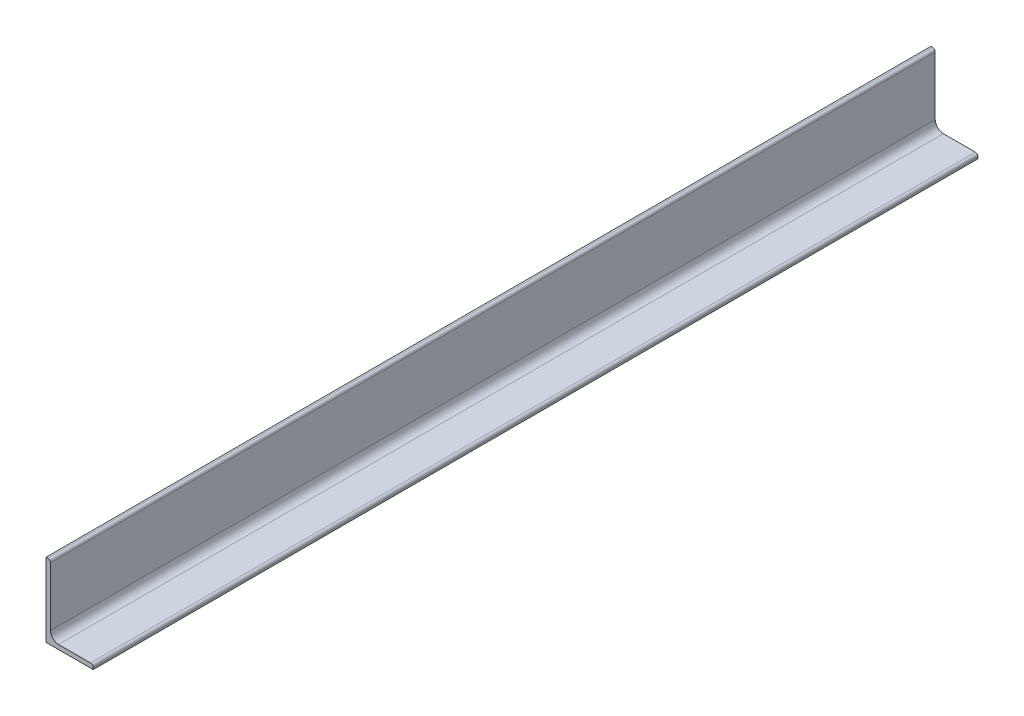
ISO-10303-21;
HEADER;
FILE_DESCRIPTION(('STEP AP214'),'2;1');
FILE_NAME('part.step','',(''),(''),'','','');
FILE_SCHEMA(('AUTOMOTIVE_DESIGN { 1 0 10303 214 1 1 1 1 }'));
ENDSEC;
DATA;
#1=APPLICATION_CONTEXT('core data for automotive mechanical design processes');
#2=APPLICATION_PROTOCOL_DEFINITION('international standard','automotive_design',2000,#1);
#3=PRODUCT_CONTEXT('',#1,'mechanical');
#4=PRODUCT('Part','Part','',(#3));
#5=PRODUCT_RELATED_PRODUCT_CATEGORY('part','',(#4));
#6=PRODUCT_DEFINITION_FORMATION('','',#4);
#7=PRODUCT_DEFINITION_CONTEXT('part definition',#1,'design');
#8=PRODUCT_DEFINITION('design','',#6,#7);
#9=PRODUCT_DEFINITION_SHAPE('','',#8);
#10=(LENGTH_UNIT() NAMED_UNIT(*) SI_UNIT(.MILLI.,.METRE.));
#11=(NAMED_UNIT(*) PLANE_ANGLE_UNIT() SI_UNIT($,.RADIAN.));
#12=(NAMED_UNIT(*) SI_UNIT($,.STERADIAN.) SOLID_ANGLE_UNIT());
#13=UNCERTAINTY_MEASURE_WITH_UNIT(LENGTH_MEASURE(1.E-05),#10,'distance_accuracy_value','');
#14=(GEOMETRIC_REPRESENTATION_CONTEXT(3) GLOBAL_UNCERTAINTY_ASSIGNED_CONTEXT((#13)) GLOBAL_UNIT_ASSIGNED_CONTEXT((#10,
#11,#12)) REPRESENTATION_CONTEXT('',''));
#15=CARTESIAN_POINT('',(0.,0.,0.));
#16=DIRECTION('',(0.,0.,1.));
#17=DIRECTION('',(1.,0.,0.));
#18=AXIS2_PLACEMENT_3D('',#15,#16,#17);
#19=CARTESIAN_POINT('',(32.,0.,600.));
#20=DIRECTION('',(0.,1.,0.));
#21=DIRECTION('',(-1.,0.,0.));
#22=AXIS2_PLACEMENT_3D('',#19,#20,#21);
#23=PLANE('',#22);
#24=DIRECTION('',(1.,0.,0.));
#25=VECTOR('',#24,1.);
#26=CARTESIAN_POINT('',(32.,0.,0.));
#27=LINE('',#26,#25);
#28=CARTESIAN_POINT('',(0.,0.,0.));
#29=VERTEX_POINT('',#28);
#30=CARTESIAN_POINT('',(32.,0.,0.));
#31=VERTEX_POINT('',#30);
#32=EDGE_CURVE('E134',#29,#31,#27,.T.);
#33=ORIENTED_EDGE('',*,*,#32,.T.);
#34=DIRECTION('',(0.,0.,-1.));
#35=VECTOR('',#34,1.);
#36=CARTESIAN_POINT('',(32.,0.,600.));
#37=LINE('',#36,#35);
#38=CARTESIAN_POINT('',(32.,0.,600.));
#39=VERTEX_POINT('',#38);
#40=EDGE_CURVE('E11',#39,#31,#37,.T.);
#41=ORIENTED_EDGE('',*,*,#40,.F.);
#42=DIRECTION('',(1.,0.,0.));
#43=VECTOR('',#42,1.);
#44=CARTESIAN_POINT('',(32.,0.,600.));
#45=LINE('',#44,#43);
#46=CARTESIAN_POINT('',(0.,0.,600.));
#47=VERTEX_POINT('',#46);
#48=EDGE_CURVE('E150',#47,#39,#45,.T.);
#49=ORIENTED_EDGE('',*,*,#48,.F.);
#50=DIRECTION('',(0.,0.,-1.));
#51=VECTOR('',#50,1.);
#52=CARTESIAN_POINT('',(0.,0.,600.));
#53=LINE('',#52,#51);
#54=EDGE_CURVE('E130',#47,#29,#53,.T.);
#55=ORIENTED_EDGE('',*,*,#54,.T.);
#56=EDGE_LOOP('',(#33,#41,#49,#55));
#57=FACE_BOUND('',#56,.T.);
#58=ADVANCED_FACE('F32',(#57),#23,.F.);
#59=CARTESIAN_POINT('',(32.,1.2,600.));
#60=DIRECTION('',(-1.,0.,0.));
#61=DIRECTION('',(0.,0.,1.));
#62=AXIS2_PLACEMENT_3D('',#59,#60,#61);
#63=PLANE('',#62);
#64=DIRECTION('',(0.,1.,0.));
#65=VECTOR('',#64,1.);
#66=CARTESIAN_POINT('',(32.,1.2,0.));
#67=LINE('',#66,#65);
#68=CARTESIAN_POINT('',(32.,1.2,0.));
#69=VERTEX_POINT('',#68);
#70=EDGE_CURVE('E137',#31,#69,#67,.T.);
#71=ORIENTED_EDGE('',*,*,#70,.T.);
#72=DIRECTION('',(0.,0.,-1.));
#73=VECTOR('',#72,1.);
#74=CARTESIAN_POINT('',(32.,1.2,600.));
#75=LINE('',#74,#73);
#76=CARTESIAN_POINT('',(32.,1.2,600.));
#77=VERTEX_POINT('',#76);
#78=EDGE_CURVE('E40',#77,#69,#75,.T.);
#79=ORIENTED_EDGE('',*,*,#78,.F.);
#80=DIRECTION('',(0.,1.,0.));
#81=VECTOR('',#80,1.);
#82=CARTESIAN_POINT('',(32.,1.2,600.));
#83=LINE('',#82,#81);
#84=EDGE_CURVE('E94',#39,#77,#83,.T.);
#85=ORIENTED_EDGE('',*,*,#84,.F.);
#86=ORIENTED_EDGE('',*,*,#40,.T.);
#87=EDGE_LOOP('',(#71,#79,#85,#86));
#88=FACE_BOUND('',#87,.T.);
#89=ADVANCED_FACE('F193',(#88),#63,.F.);
#90=CARTESIAN_POINT('',(30.2,1.2,600.));
#91=DIRECTION('',(0.,0.,-1.));
#92=DIRECTION('',(-1.,0.,0.));
#93=AXIS2_PLACEMENT_3D('',#90,#91,#92);
#94=CYLINDRICAL_SURFACE('',#93,1.8);
#95=CARTESIAN_POINT('',(30.2,1.2,0.));
#96=DIRECTION('',(0.,0.,1.));
#97=DIRECTION('',(1.,0.,0.));
#98=AXIS2_PLACEMENT_3D('',#95,#96,#97);
#99=CIRCLE('',#98,1.8);
#100=CARTESIAN_POINT('',(30.2,3.,0.));
#101=VERTEX_POINT('',#100);
#102=EDGE_CURVE('E139',#69,#101,#99,.T.);
#103=ORIENTED_EDGE('',*,*,#102,.T.);
#104=DIRECTION('',(0.,0.,-1.));
#105=VECTOR('',#104,1.);
#106=CARTESIAN_POINT('',(30.2,3.,600.));
#107=LINE('',#106,#105);
#108=CARTESIAN_POINT('',(30.2,3.,600.));
#109=VERTEX_POINT('',#108);
#110=EDGE_CURVE('E160',#109,#101,#107,.T.);
#111=ORIENTED_EDGE('',*,*,#110,.F.);
#112=CARTESIAN_POINT('',(30.2,1.2,600.));
#113=DIRECTION('',(0.,0.,1.));
#114=DIRECTION('',(1.,0.,0.));
#115=AXIS2_PLACEMENT_3D('',#112,#113,#114);
#116=CIRCLE('',#115,1.8);
#117=EDGE_CURVE('E168',#77,#109,#116,.T.);
#118=ORIENTED_EDGE('',*,*,#117,.F.);
#119=ORIENTED_EDGE('',*,*,#78,.T.);
#120=EDGE_LOOP('',(#103,#111,#118,#119));
#121=FACE_BOUND('',#120,.T.);
#122=ADVANCED_FACE('F166',(#121),#94,.T.);
#123=CARTESIAN_POINT('',(8.50000000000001,3.,600.));
#124=DIRECTION('',(0.,-1.,0.));
#125=DIRECTION('',(0.,0.,-1.));
#126=AXIS2_PLACEMENT_3D('',#123,#124,#125);
#127=PLANE('',#126);
#128=DIRECTION('',(-1.,0.,0.));
#129=VECTOR('',#128,1.);
#130=CARTESIAN_POINT('',(8.50000000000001,3.,0.));
#131=LINE('',#130,#129);
#132=CARTESIAN_POINT('',(8.50000000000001,3.,0.));
#133=VERTEX_POINT('',#132);
#134=EDGE_CURVE('E141',#101,#133,#131,.T.);
#135=ORIENTED_EDGE('',*,*,#134,.T.);
#136=DIRECTION('',(0.,0.,-1.));
#137=VECTOR('',#136,1.);
#138=CARTESIAN_POINT('',(8.50000000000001,3.,600.));
#139=LINE('',#138,#137);
#140=CARTESIAN_POINT('',(8.50000000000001,3.,600.));
#141=VERTEX_POINT('',#140);
#142=EDGE_CURVE('E157',#141,#133,#139,.T.);
#143=ORIENTED_EDGE('',*,*,#142,.F.);
#144=DIRECTION('',(-1.,0.,0.));
#145=VECTOR('',#144,1.);
#146=CARTESIAN_POINT('',(8.50000000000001,3.,600.));
#147=LINE('',#146,#145);
#148=EDGE_CURVE('E184',#109,#141,#147,.T.);
#149=ORIENTED_EDGE('',*,*,#148,.F.);
#150=ORIENTED_EDGE('',*,*,#110,.T.);
#151=EDGE_LOOP('',(#135,#143,#149,#150));
#152=FACE_BOUND('',#151,.T.);
#153=ADVANCED_FACE('F177',(#152),#127,.F.);
#154=CARTESIAN_POINT('',(8.50000000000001,8.5,600.));
#155=DIRECTION('',(0.,0.,-1.));
#156=DIRECTION('',(-1.,0.,0.));
#157=AXIS2_PLACEMENT_3D('',#154,#155,#156);
#158=CYLINDRICAL_SURFACE('',#157,5.5);
#159=CARTESIAN_POINT('',(8.50000000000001,8.5,0.));
#160=DIRECTION('',(0.,0.,-1.));
#161=DIRECTION('',(-1.,0.,0.));
#162=AXIS2_PLACEMENT_3D('',#159,#160,#161);
#163=CIRCLE('',#162,5.5);
#164=CARTESIAN_POINT('',(3.00000000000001,8.5,0.));
#165=VERTEX_POINT('',#164);
#166=EDGE_CURVE('E143',#133,#165,#163,.T.);
#167=ORIENTED_EDGE('',*,*,#166,.T.);
#168=DIRECTION('',(0.,0.,-1.));
#169=VECTOR('',#168,1.);
#170=CARTESIAN_POINT('',(3.00000000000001,8.5,600.));
#171=LINE('',#170,#169);
#172=CARTESIAN_POINT('',(3.00000000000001,8.5,600.));
#173=VERTEX_POINT('',#172);
#174=EDGE_CURVE('E154',#173,#165,#171,.T.);
#175=ORIENTED_EDGE('',*,*,#174,.F.);
#176=CARTESIAN_POINT('',(8.50000000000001,8.5,600.));
#177=DIRECTION('',(0.,0.,-1.));
#178=DIRECTION('',(-1.,0.,0.));
#179=AXIS2_PLACEMENT_3D('',#176,#177,#178);
#180=CIRCLE('',#179,5.5);
#181=EDGE_CURVE('E183',#141,#173,#180,.T.);
#182=ORIENTED_EDGE('',*,*,#181,.F.);
#183=ORIENTED_EDGE('',*,*,#142,.T.);
#184=EDGE_LOOP('',(#167,#175,#182,#183));
#185=FACE_BOUND('',#184,.T.);
#186=ADVANCED_FACE('F181',(#185),#158,.F.);
#187=CARTESIAN_POINT('',(3.,48.2,600.));
#188=DIRECTION('',(-1.,0.,0.));
#189=DIRECTION('',(0.,-1.,0.));
#190=AXIS2_PLACEMENT_3D('',#187,#188,#189);
#191=PLANE('',#190);
#192=DIRECTION('',(0.,1.,0.));
#193=VECTOR('',#192,1.);
#194=CARTESIAN_POINT('',(3.,48.2,0.));
#195=LINE('',#194,#193);
#196=CARTESIAN_POINT('',(3.00000000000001,48.2,0.));
#197=VERTEX_POINT('',#196);
#198=EDGE_CURVE('E145',#165,#197,#195,.T.);
#199=ORIENTED_EDGE('',*,*,#198,.T.);
#200=DIRECTION('',(0.,0.,-1.));
#201=VECTOR('',#200,1.);
#202=CARTESIAN_POINT('',(3.00000000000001,48.2,600.));
#203=LINE('',#202,#201);
#204=CARTESIAN_POINT('',(3.00000000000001,48.2,600.));
#205=VERTEX_POINT('',#204);
#206=EDGE_CURVE('E125',#205,#197,#203,.T.);
#207=ORIENTED_EDGE('',*,*,#206,.F.);
#208=DIRECTION('',(0.,1.,0.));
#209=VECTOR('',#208,1.);
#210=CARTESIAN_POINT('',(3.,48.2,600.));
#211=LINE('',#210,#209);
#212=EDGE_CURVE('E116',#173,#205,#211,.T.);
#213=ORIENTED_EDGE('',*,*,#212,.F.);
#214=ORIENTED_EDGE('',*,*,#174,.T.);
#215=EDGE_LOOP('',(#199,#207,#213,#214));
#216=FACE_BOUND('',#215,.T.);
#217=ADVANCED_FACE('F205',(#216),#191,.F.);
#218=CARTESIAN_POINT('',(1.2,48.2,600.));
#219=DIRECTION('',(0.,0.,-1.));
#220=DIRECTION('',(-1.,0.,0.));
#221=AXIS2_PLACEMENT_3D('',#218,#219,#220);
#222=CYLINDRICAL_SURFACE('',#221,1.8);
#223=CARTESIAN_POINT('',(1.2,48.2,0.));
#224=DIRECTION('',(0.,0.,1.));
#225=DIRECTION('',(1.,0.,0.));
#226=AXIS2_PLACEMENT_3D('',#223,#224,#225);
#227=CIRCLE('',#226,1.8);
#228=CARTESIAN_POINT('',(1.2,50.,0.));
#229=VERTEX_POINT('',#228);
#230=EDGE_CURVE('E124',#197,#229,#227,.T.);
#231=ORIENTED_EDGE('',*,*,#230,.T.);
#232=DIRECTION('',(0.,0.,-1.));
#233=VECTOR('',#232,1.);
#234=CARTESIAN_POINT('',(1.2,50.,600.));
#235=LINE('',#234,#233);
#236=CARTESIAN_POINT('',(1.2,50.,600.));
#237=VERTEX_POINT('',#236);
#238=EDGE_CURVE('E121',#237,#229,#235,.T.);
#239=ORIENTED_EDGE('',*,*,#238,.F.);
#240=CARTESIAN_POINT('',(1.2,48.2,600.));
#241=DIRECTION('',(0.,0.,1.));
#242=DIRECTION('',(1.,0.,0.));
#243=AXIS2_PLACEMENT_3D('',#240,#241,#242);
#244=CIRCLE('',#243,1.8);
#245=EDGE_CURVE('E110',#205,#237,#244,.T.);
#246=ORIENTED_EDGE('',*,*,#245,.F.);
#247=ORIENTED_EDGE('',*,*,#206,.T.);
#248=EDGE_LOOP('',(#231,#239,#246,#247));
#249=FACE_BOUND('',#248,.T.);
#250=ADVANCED_FACE('F122',(#249),#222,.T.);
#251=CARTESIAN_POINT('',(0.,50.,600.));
#252=DIRECTION('',(0.,-1.,0.));
#253=DIRECTION('',(1.,0.,0.));
#254=AXIS2_PLACEMENT_3D('',#251,#252,#253);
#255=PLANE('',#254);
#256=DIRECTION('',(-1.,0.,0.));
#257=VECTOR('',#256,1.);
#258=CARTESIAN_POINT('',(0.,50.,0.));
#259=LINE('',#258,#257);
#260=CARTESIAN_POINT('',(0.,50.,0.));
#261=VERTEX_POINT('',#260);
#262=EDGE_CURVE('E80',#229,#261,#259,.T.);
#263=ORIENTED_EDGE('',*,*,#262,.T.);
#264=DIRECTION('',(0.,0.,-1.));
#265=VECTOR('',#264,1.);
#266=CARTESIAN_POINT('',(0.,50.,600.));
#267=LINE('',#266,#265);
#268=CARTESIAN_POINT('',(0.,50.,600.));
#269=VERTEX_POINT('',#268);
#270=EDGE_CURVE('E126',#269,#261,#267,.T.);
#271=ORIENTED_EDGE('',*,*,#270,.F.);
#272=DIRECTION('',(-1.,0.,0.));
#273=VECTOR('',#272,1.);
#274=CARTESIAN_POINT('',(0.,50.,600.));
#275=LINE('',#274,#273);
#276=EDGE_CURVE('E114',#237,#269,#275,.T.);
#277=ORIENTED_EDGE('',*,*,#276,.F.);
#278=ORIENTED_EDGE('',*,*,#238,.T.);
#279=EDGE_LOOP('',(#263,#271,#277,#278));
#280=FACE_BOUND('',#279,.T.);
#281=ADVANCED_FACE('F128',(#280),#255,.F.);
#282=CARTESIAN_POINT('',(0.,0.,600.));
#283=DIRECTION('',(1.,0.,0.));
#284=DIRECTION('',(0.,0.,-1.));
#285=AXIS2_PLACEMENT_3D('',#282,#283,#284);
#286=PLANE('',#285);
#287=DIRECTION('',(0.,-1.,0.));
#288=VECTOR('',#287,1.);
#289=CARTESIAN_POINT('',(0.,0.,0.));
#290=LINE('',#289,#288);
#291=EDGE_CURVE('E86',#261,#29,#290,.T.);
#292=ORIENTED_EDGE('',*,*,#291,.T.);
#293=ORIENTED_EDGE('',*,*,#54,.F.);
#294=DIRECTION('',(0.,-1.,0.));
#295=VECTOR('',#294,1.);
#296=CARTESIAN_POINT('',(0.,0.,600.));
#297=LINE('',#296,#295);
#298=EDGE_CURVE('E48',#269,#47,#297,.T.);
#299=ORIENTED_EDGE('',*,*,#298,.F.);
#300=ORIENTED_EDGE('',*,*,#270,.T.);
#301=EDGE_LOOP('',(#292,#293,#299,#300));
#302=FACE_BOUND('',#301,.T.);
#303=ADVANCED_FACE('F213',(#302),#286,.F.);
#304=CARTESIAN_POINT('',(1.2,48.2,600.));
#305=DIRECTION('',(0.,0.,1.));
#306=DIRECTION('',(1.,0.,0.));
#307=AXIS2_PLACEMENT_3D('',#304,#305,#306);
#308=PLANE('',#307);
#309=ORIENTED_EDGE('',*,*,#48,.T.);
#310=ORIENTED_EDGE('',*,*,#84,.T.);
#311=ORIENTED_EDGE('',*,*,#117,.T.);
#312=ORIENTED_EDGE('',*,*,#148,.T.);
#313=ORIENTED_EDGE('',*,*,#181,.T.);
#314=ORIENTED_EDGE('',*,*,#212,.T.);
#315=ORIENTED_EDGE('',*,*,#245,.T.);
#316=ORIENTED_EDGE('',*,*,#276,.T.);
#317=ORIENTED_EDGE('',*,*,#298,.T.);
#318=EDGE_LOOP('',(#309,#310,#311,#312,#313,#314,#315,#316,#317));
#319=FACE_BOUND('',#318,.T.);
#320=ADVANCED_FACE('F112',(#319),#308,.T.);
#321=CARTESIAN_POINT('',(1.2,48.2,0.));
#322=DIRECTION('',(0.,0.,1.));
#323=DIRECTION('',(1.,0.,0.));
#324=AXIS2_PLACEMENT_3D('',#321,#322,#323);
#325=PLANE('',#324);
#326=ORIENTED_EDGE('',*,*,#32,.F.);
#327=ORIENTED_EDGE('',*,*,#291,.F.);
#328=ORIENTED_EDGE('',*,*,#262,.F.);
#329=ORIENTED_EDGE('',*,*,#230,.F.);
#330=ORIENTED_EDGE('',*,*,#198,.F.);
#331=ORIENTED_EDGE('',*,*,#166,.F.);
#332=ORIENTED_EDGE('',*,*,#134,.F.);
#333=ORIENTED_EDGE('',*,*,#102,.F.);
#334=ORIENTED_EDGE('',*,*,#70,.F.);
#335=EDGE_LOOP('',(#326,#327,#328,#329,#330,#331,#332,#333,#334));
#336=FACE_BOUND('',#335,.T.);
#337=ADVANCED_FACE('F172',(#336),#325,.F.);
#338=CLOSED_SHELL('',(#58,#89,#122,#153,#186,#217,#250,#281,#303,#320,#337));
#339=MANIFOLD_SOLID_BREP('B2',#338);
#340=ADVANCED_BREP_SHAPE_REPRESENTATION('',(#18,#339),#14);
#341=SHAPE_DEFINITION_REPRESENTATION(#9,#340);
ENDSEC;
END-ISO-10303-21;
